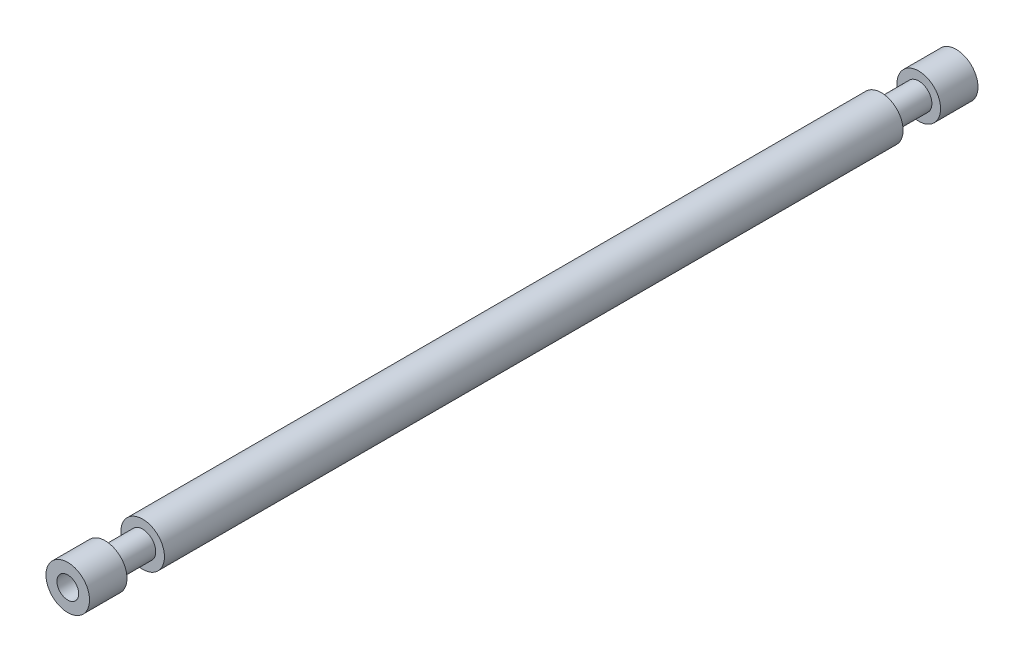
ISO-10303-21;
HEADER;
FILE_DESCRIPTION(('STEP AP214'),'2;1');
FILE_NAME('part.step','',(''),(''),'','','');
FILE_SCHEMA(('AUTOMOTIVE_DESIGN { 1 0 10303 214 1 1 1 1 }'));
ENDSEC;
DATA;
#1=APPLICATION_CONTEXT('core data for automotive mechanical design processes');
#2=APPLICATION_PROTOCOL_DEFINITION('international standard','automotive_design',2000,#1);
#3=PRODUCT_CONTEXT('',#1,'mechanical');
#4=PRODUCT('Part','Part','',(#3));
#5=PRODUCT_RELATED_PRODUCT_CATEGORY('part','',(#4));
#6=PRODUCT_DEFINITION_FORMATION('','',#4);
#7=PRODUCT_DEFINITION_CONTEXT('part definition',#1,'design');
#8=PRODUCT_DEFINITION('design','',#6,#7);
#9=PRODUCT_DEFINITION_SHAPE('','',#8);
#10=(LENGTH_UNIT() NAMED_UNIT(*) SI_UNIT(.MILLI.,.METRE.));
#11=(NAMED_UNIT(*) PLANE_ANGLE_UNIT() SI_UNIT($,.RADIAN.));
#12=(NAMED_UNIT(*) SI_UNIT($,.STERADIAN.) SOLID_ANGLE_UNIT());
#13=UNCERTAINTY_MEASURE_WITH_UNIT(LENGTH_MEASURE(1.E-05),#10,'distance_accuracy_value','');
#14=(GEOMETRIC_REPRESENTATION_CONTEXT(3) GLOBAL_UNCERTAINTY_ASSIGNED_CONTEXT((#13)) GLOBAL_UNIT_ASSIGNED_CONTEXT((#10,
#11,#12)) REPRESENTATION_CONTEXT('',''));
#15=CARTESIAN_POINT('',(0.,0.,0.));
#16=DIRECTION('',(0.,0.,1.));
#17=DIRECTION('',(1.,0.,0.));
#18=AXIS2_PLACEMENT_3D('',#15,#16,#17);
#19=CARTESIAN_POINT('',(0.,0.,259.08));
#20=DIRECTION('',(0.,0.,1.));
#21=DIRECTION('',(1.,0.,0.));
#22=AXIS2_PLACEMENT_3D('',#19,#20,#21);
#23=PLANE('',#22);
#24=CARTESIAN_POINT('',(0.,0.,259.08));
#25=DIRECTION('',(0.,0.,1.));
#26=DIRECTION('',(1.,0.,0.));
#27=AXIS2_PLACEMENT_3D('',#24,#25,#26);
#28=CIRCLE('',#27,6.35);
#29=CARTESIAN_POINT('',(6.35,0.,259.08));
#30=VERTEX_POINT('',#29);
#31=EDGE_CURVE('E11',#30,#30,#28,.T.);
#32=ORIENTED_EDGE('',*,*,#31,.T.);
#33=EDGE_LOOP('',(#32));
#34=FACE_BOUND('',#33,.T.);
#35=CARTESIAN_POINT('',(0.0144943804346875,0.00457175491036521,259.079999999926));
#36=DIRECTION('',(0.,0.,1.));
#37=DIRECTION('',(1.,0.,0.));
#38=AXIS2_PLACEMENT_3D('',#35,#36,#37);
#39=CIRCLE('',#38,3.17499725);
#40=CARTESIAN_POINT('',(3.18949163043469,0.00457175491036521,259.079999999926));
#41=VERTEX_POINT('',#40);
#42=EDGE_CURVE('E224',#41,#41,#39,.T.);
#43=ORIENTED_EDGE('',*,*,#42,.F.);
#44=EDGE_LOOP('',(#43));
#45=FACE_BOUND('',#44,.T.);
#46=ADVANCED_FACE('F28',(#34,#45),#23,.T.);
#47=CARTESIAN_POINT('',(0.,0.,0.));
#48=DIRECTION('',(0.,0.,1.));
#49=DIRECTION('',(1.,0.,0.));
#50=AXIS2_PLACEMENT_3D('',#47,#48,#49);
#51=PLANE('',#50);
#52=CARTESIAN_POINT('',(0.,0.,0.));
#53=DIRECTION('',(0.,0.,1.));
#54=DIRECTION('',(1.,0.,0.));
#55=AXIS2_PLACEMENT_3D('',#52,#53,#54);
#56=CIRCLE('',#55,6.35);
#57=CARTESIAN_POINT('',(6.35,0.,0.));
#58=VERTEX_POINT('',#57);
#59=EDGE_CURVE('E37',#58,#58,#56,.T.);
#60=ORIENTED_EDGE('',*,*,#59,.F.);
#61=EDGE_LOOP('',(#60));
#62=FACE_BOUND('',#61,.T.);
#63=CARTESIAN_POINT('',(0.00308593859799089,-0.0113117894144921,-5.6841865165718E-11));
#64=DIRECTION('',(0.,0.,-1.));
#65=DIRECTION('',(-1.,0.,0.));
#66=AXIS2_PLACEMENT_3D('',#63,#64,#65);
#67=CIRCLE('',#66,2.552697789);
#68=CARTESIAN_POINT('',(-2.54961185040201,-0.0113117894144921,-5.6841865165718E-11));
#69=VERTEX_POINT('',#68);
#70=EDGE_CURVE('E108',#69,#69,#67,.T.);
#71=ORIENTED_EDGE('',*,*,#70,.F.);
#72=EDGE_LOOP('',(#71));
#73=FACE_BOUND('',#72,.T.);
#74=ADVANCED_FACE('F62',(#62,#73),#51,.F.);
#75=CARTESIAN_POINT('',(0.,0.,259.08));
#76=DIRECTION('',(0.,0.,-1.));
#77=DIRECTION('',(-1.,0.,0.));
#78=AXIS2_PLACEMENT_3D('',#75,#76,#77);
#79=CYLINDRICAL_SURFACE('',#78,6.35);
#80=CARTESIAN_POINT('',(0.,0.,237.236));
#81=DIRECTION('',(0.,0.,1.));
#82=DIRECTION('',(1.,0.,0.));
#83=AXIS2_PLACEMENT_3D('',#80,#81,#82);
#84=CIRCLE('',#83,6.35);
#85=CARTESIAN_POINT('',(6.35,0.,237.236));
#86=VERTEX_POINT('',#85);
#87=EDGE_CURVE('E129',#86,#86,#84,.T.);
#88=ORIENTED_EDGE('',*,*,#87,.F.);
#89=EDGE_LOOP('',(#88));
#90=FACE_BOUND('',#89,.T.);
#91=CARTESIAN_POINT('',(0.,0.,21.844));
#92=DIRECTION('',(0.,0.,-1.));
#93=DIRECTION('',(-1.,0.,0.));
#94=AXIS2_PLACEMENT_3D('',#91,#92,#93);
#95=CIRCLE('',#94,6.35);
#96=CARTESIAN_POINT('',(-6.35,0.,21.844));
#97=VERTEX_POINT('',#96);
#98=EDGE_CURVE('E32',#97,#97,#95,.T.);
#99=ORIENTED_EDGE('',*,*,#98,.F.);
#100=EDGE_LOOP('',(#99));
#101=FACE_BOUND('',#100,.T.);
#102=ADVANCED_FACE('F67',(#90,#101),#79,.T.);
#103=CARTESIAN_POINT('',(0.,0.,237.236));
#104=DIRECTION('',(0.,0.,1.));
#105=DIRECTION('',(1.,0.,0.));
#106=AXIS2_PLACEMENT_3D('',#103,#104,#105);
#107=PLANE('',#106);
#108=CARTESIAN_POINT('',(0.,0.,237.236));
#109=DIRECTION('',(0.,0.,1.));
#110=DIRECTION('',(1.,0.,0.));
#111=AXIS2_PLACEMENT_3D('',#108,#109,#110);
#112=CIRCLE('',#111,3.81);
#113=CARTESIAN_POINT('',(3.81,0.,237.236));
#114=VERTEX_POINT('',#113);
#115=EDGE_CURVE('E124',#114,#114,#112,.T.);
#116=ORIENTED_EDGE('',*,*,#115,.F.);
#117=EDGE_LOOP('',(#116));
#118=FACE_BOUND('',#117,.T.);
#119=ORIENTED_EDGE('',*,*,#87,.T.);
#120=EDGE_LOOP('',(#119));
#121=FACE_BOUND('',#120,.T.);
#122=ADVANCED_FACE('F72',(#118,#121),#107,.T.);
#123=CARTESIAN_POINT('',(0.,0.,248.158));
#124=DIRECTION('',(0.,0.,1.));
#125=DIRECTION('',(1.,0.,0.));
#126=AXIS2_PLACEMENT_3D('',#123,#124,#125);
#127=PLANE('',#126);
#128=CARTESIAN_POINT('',(0.,0.,248.158));
#129=DIRECTION('',(0.,0.,1.));
#130=DIRECTION('',(1.,0.,0.));
#131=AXIS2_PLACEMENT_3D('',#128,#129,#130);
#132=CIRCLE('',#131,3.81);
#133=CARTESIAN_POINT('',(3.81,0.,248.158));
#134=VERTEX_POINT('',#133);
#135=EDGE_CURVE('E121',#134,#134,#132,.T.);
#136=ORIENTED_EDGE('',*,*,#135,.T.);
#137=EDGE_LOOP('',(#136));
#138=FACE_BOUND('',#137,.T.);
#139=CARTESIAN_POINT('',(0.,0.,248.158));
#140=DIRECTION('',(0.,0.,1.));
#141=DIRECTION('',(1.,0.,0.));
#142=AXIS2_PLACEMENT_3D('',#139,#140,#141);
#143=CIRCLE('',#142,6.35);
#144=CARTESIAN_POINT('',(6.35,0.,248.158));
#145=VERTEX_POINT('',#144);
#146=EDGE_CURVE('E127',#145,#145,#143,.T.);
#147=ORIENTED_EDGE('',*,*,#146,.F.);
#148=EDGE_LOOP('',(#147));
#149=FACE_BOUND('',#148,.T.);
#150=ADVANCED_FACE('F75',(#138,#149),#127,.F.);
#151=CARTESIAN_POINT('',(0.,0.,237.236));
#152=DIRECTION('',(0.,0.,1.));
#153=DIRECTION('',(1.,0.,0.));
#154=AXIS2_PLACEMENT_3D('',#151,#152,#153);
#155=CYLINDRICAL_SURFACE('',#154,3.81);
#156=ORIENTED_EDGE('',*,*,#115,.T.);
#157=EDGE_LOOP('',(#156));
#158=FACE_BOUND('',#157,.T.);
#159=ORIENTED_EDGE('',*,*,#135,.F.);
#160=EDGE_LOOP('',(#159));
#161=FACE_BOUND('',#160,.T.);
#162=ADVANCED_FACE('F79',(#158,#161),#155,.T.);
#163=ORIENTED_EDGE('',*,*,#146,.T.);
#164=EDGE_LOOP('',(#163));
#165=FACE_BOUND('',#164,.T.);
#166=ORIENTED_EDGE('',*,*,#31,.F.);
#167=EDGE_LOOP('',(#166));
#168=FACE_BOUND('',#167,.T.);
#169=ADVANCED_FACE('F30',(#165,#168),#79,.T.);
#170=CARTESIAN_POINT('',(0.,0.,21.844));
#171=DIRECTION('',(0.,0.,-1.));
#172=DIRECTION('',(-1.,0.,0.));
#173=AXIS2_PLACEMENT_3D('',#170,#171,#172);
#174=PLANE('',#173);
#175=CARTESIAN_POINT('',(0.,0.,21.844));
#176=DIRECTION('',(0.,0.,-1.));
#177=DIRECTION('',(-1.,0.,0.));
#178=AXIS2_PLACEMENT_3D('',#175,#176,#177);
#179=CIRCLE('',#178,3.82990044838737);
#180=CARTESIAN_POINT('',(-3.82990044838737,0.,21.844));
#181=VERTEX_POINT('',#180);
#182=EDGE_CURVE('E111',#181,#181,#179,.T.);
#183=ORIENTED_EDGE('',*,*,#182,.F.);
#184=EDGE_LOOP('',(#183));
#185=FACE_BOUND('',#184,.T.);
#186=ORIENTED_EDGE('',*,*,#98,.T.);
#187=EDGE_LOOP('',(#186));
#188=FACE_BOUND('',#187,.T.);
#189=ADVANCED_FACE('F84',(#185,#188),#174,.T.);
#190=CARTESIAN_POINT('',(0.,0.,10.922));
#191=DIRECTION('',(0.,0.,-1.));
#192=DIRECTION('',(-1.,0.,0.));
#193=AXIS2_PLACEMENT_3D('',#190,#191,#192);
#194=PLANE('',#193);
#195=CARTESIAN_POINT('',(0.,0.,10.922));
#196=DIRECTION('',(0.,0.,-1.));
#197=DIRECTION('',(-1.,0.,0.));
#198=AXIS2_PLACEMENT_3D('',#195,#196,#197);
#199=CIRCLE('',#198,3.82990044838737);
#200=CARTESIAN_POINT('',(-3.82990044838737,0.,10.922));
#201=VERTEX_POINT('',#200);
#202=EDGE_CURVE('E107',#201,#201,#199,.T.);
#203=ORIENTED_EDGE('',*,*,#202,.T.);
#204=EDGE_LOOP('',(#203));
#205=FACE_BOUND('',#204,.T.);
#206=CARTESIAN_POINT('',(0.,0.,10.922));
#207=DIRECTION('',(0.,0.,-1.));
#208=DIRECTION('',(-1.,0.,0.));
#209=AXIS2_PLACEMENT_3D('',#206,#207,#208);
#210=CIRCLE('',#209,6.35);
#211=CARTESIAN_POINT('',(-6.35,0.,10.922));
#212=VERTEX_POINT('',#211);
#213=EDGE_CURVE('E120',#212,#212,#210,.T.);
#214=ORIENTED_EDGE('',*,*,#213,.F.);
#215=EDGE_LOOP('',(#214));
#216=FACE_BOUND('',#215,.T.);
#217=ADVANCED_FACE('F87',(#205,#216),#194,.F.);
#218=CARTESIAN_POINT('',(0.,0.,21.844));
#219=DIRECTION('',(0.,0.,-1.));
#220=DIRECTION('',(-1.,0.,0.));
#221=AXIS2_PLACEMENT_3D('',#218,#219,#220);
#222=CYLINDRICAL_SURFACE('',#221,3.82990044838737);
#223=ORIENTED_EDGE('',*,*,#182,.T.);
#224=EDGE_LOOP('',(#223));
#225=FACE_BOUND('',#224,.T.);
#226=ORIENTED_EDGE('',*,*,#202,.F.);
#227=EDGE_LOOP('',(#226));
#228=FACE_BOUND('',#227,.T.);
#229=ADVANCED_FACE('F91',(#225,#228),#222,.T.);
#230=ORIENTED_EDGE('',*,*,#213,.T.);
#231=EDGE_LOOP('',(#230));
#232=FACE_BOUND('',#231,.T.);
#233=ORIENTED_EDGE('',*,*,#59,.T.);
#234=EDGE_LOOP('',(#233));
#235=FACE_BOUND('',#234,.T.);
#236=ADVANCED_FACE('F95',(#232,#235),#79,.T.);
#237=CARTESIAN_POINT('',(0.00308593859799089,-0.0113117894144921,25.3999779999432));
#238=DIRECTION('',(0.,0.,-1.));
#239=DIRECTION('',(-1.,0.,0.));
#240=AXIS2_PLACEMENT_3D('',#237,#238,#239);
#241=CONICAL_SURFACE('',#240,0.,1.0297443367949);
#242=CARTESIAN_POINT('',(0.00308593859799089,-0.0113117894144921,23.8661626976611));
#243=DIRECTION('',(0.,0.,-1.));
#244=DIRECTION('',(-1.,0.,0.));
#245=AXIS2_PLACEMENT_3D('',#242,#243,#244);
#246=CIRCLE('',#245,2.552697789);
#247=CARTESIAN_POINT('',(-2.54961185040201,-0.0113117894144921,23.8661626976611));
#248=VERTEX_POINT('',#247);
#249=EDGE_CURVE('E105',#248,#248,#246,.T.);
#250=ORIENTED_EDGE('',*,*,#249,.T.);
#251=EDGE_LOOP('',(#250));
#252=FACE_BOUND('',#251,.T.);
#253=CARTESIAN_POINT('',(0.00308593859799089,-0.0113117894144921,25.3999779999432));
#254=VERTEX_POINT('',#253);
#255=VERTEX_LOOP('',#254);
#256=FACE_BOUND('',#255,.T.);
#257=ADVANCED_FACE('F57',(#252,#256),#241,.F.);
#258=CARTESIAN_POINT('',(0.00308593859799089,-0.0113117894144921,-5.6843418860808E-11));
#259=DIRECTION('',(0.,0.,-1.));
#260=DIRECTION('',(-1.,0.,0.));
#261=AXIS2_PLACEMENT_3D('',#258,#259,#260);
#262=CYLINDRICAL_SURFACE('',#261,2.552697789);
#263=ORIENTED_EDGE('',*,*,#70,.T.);
#264=EDGE_LOOP('',(#263));
#265=FACE_BOUND('',#264,.T.);
#266=ORIENTED_EDGE('',*,*,#249,.F.);
#267=EDGE_LOOP('',(#266));
#268=FACE_BOUND('',#267,.T.);
#269=ADVANCED_FACE('F47',(#265,#268),#262,.F.);
#270=CARTESIAN_POINT('',(0.0144943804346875,0.00457175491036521,246.380010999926));
#271=DIRECTION('',(0.,0.,1.));
#272=DIRECTION('',(1.,0.,0.));
#273=AXIS2_PLACEMENT_3D('',#270,#271,#272);
#274=CONICAL_SURFACE('',#273,0.,1.0297443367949);
#275=CARTESIAN_POINT('',(0.0144943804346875,0.00457175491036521,247.913826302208));
#276=DIRECTION('',(0.,0.,1.));
#277=DIRECTION('',(1.,0.,0.));
#278=AXIS2_PLACEMENT_3D('',#275,#276,#277);
#279=CIRCLE('',#278,2.552697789);
#280=CARTESIAN_POINT('',(2.56719216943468,0.00457175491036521,247.913826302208));
#281=VERTEX_POINT('',#280);
#282=EDGE_CURVE('E114',#281,#281,#279,.T.);
#283=ORIENTED_EDGE('',*,*,#282,.T.);
#284=EDGE_LOOP('',(#283));
#285=FACE_BOUND('',#284,.T.);
#286=CARTESIAN_POINT('',(0.0144943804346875,0.00457175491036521,246.380010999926));
#287=VERTEX_POINT('',#286);
#288=VERTEX_LOOP('',#287);
#289=FACE_BOUND('',#288,.T.);
#290=ADVANCED_FACE('F44',(#285,#289),#274,.F.);
#291=CARTESIAN_POINT('',(0.0144943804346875,0.00457175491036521,259.079999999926));
#292=DIRECTION('',(0.,0.,1.));
#293=DIRECTION('',(1.,0.,0.));
#294=AXIS2_PLACEMENT_3D('',#291,#292,#293);
#295=CYLINDRICAL_SURFACE('',#294,2.552697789);
#296=CARTESIAN_POINT('',(0.0144943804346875,0.00457175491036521,247.650009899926));
#297=DIRECTION('',(0.,0.,1.));
#298=DIRECTION('',(1.,0.,0.));
#299=AXIS2_PLACEMENT_3D('',#296,#297,#298);
#300=CIRCLE('',#299,2.552697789);
#301=CARTESIAN_POINT('',(2.56719216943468,0.00457175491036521,247.650009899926));
#302=VERTEX_POINT('',#301);
#303=EDGE_CURVE('E228',#302,#302,#300,.T.);
#304=ORIENTED_EDGE('',*,*,#303,.T.);
#305=EDGE_LOOP('',(#304));
#306=FACE_BOUND('',#305,.T.);
#307=ORIENTED_EDGE('',*,*,#282,.F.);
#308=EDGE_LOOP('',(#307));
#309=FACE_BOUND('',#308,.T.);
#310=ADVANCED_FACE('F46',(#306,#309),#295,.T.);
#311=CARTESIAN_POINT('',(2.56719216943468,0.00457175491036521,247.650009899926));
#312=DIRECTION('',(0.,0.,1.));
#313=DIRECTION('',(1.,0.,0.));
#314=AXIS2_PLACEMENT_3D('',#311,#312,#313);
#315=PLANE('',#314);
#316=CARTESIAN_POINT('',(0.0144943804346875,0.00457175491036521,247.650009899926));
#317=DIRECTION('',(0.,0.,1.));
#318=DIRECTION('',(1.,0.,0.));
#319=AXIS2_PLACEMENT_3D('',#316,#317,#318);
#320=CIRCLE('',#319,3.17499725);
#321=CARTESIAN_POINT('',(3.18949163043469,0.00457175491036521,247.650009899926));
#322=VERTEX_POINT('',#321);
#323=EDGE_CURVE('E227',#322,#322,#320,.T.);
#324=ORIENTED_EDGE('',*,*,#323,.T.);
#325=EDGE_LOOP('',(#324));
#326=FACE_BOUND('',#325,.T.);
#327=ORIENTED_EDGE('',*,*,#303,.F.);
#328=EDGE_LOOP('',(#327));
#329=FACE_BOUND('',#328,.T.);
#330=ADVANCED_FACE('F54',(#326,#329),#315,.T.);
#331=CARTESIAN_POINT('',(0.0144943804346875,0.00457175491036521,259.079999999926));
#332=DIRECTION('',(0.,0.,1.));
#333=DIRECTION('',(1.,0.,0.));
#334=AXIS2_PLACEMENT_3D('',#331,#332,#333);
#335=CYLINDRICAL_SURFACE('',#334,3.17499725);
#336=ORIENTED_EDGE('',*,*,#42,.T.);
#337=EDGE_LOOP('',(#336));
#338=FACE_BOUND('',#337,.T.);
#339=ORIENTED_EDGE('',*,*,#323,.F.);
#340=EDGE_LOOP('',(#339));
#341=FACE_BOUND('',#340,.T.);
#342=ADVANCED_FACE('F204',(#338,#341),#335,.F.);
#343=CLOSED_SHELL('',(#46,#74,#102,#122,#150,#162,#169,#189,#217,#229,#236,#257,#269,#290,#310,
#330,#342));
#344=MANIFOLD_SOLID_BREP('B2',#343);
#345=ADVANCED_BREP_SHAPE_REPRESENTATION('',(#18,#344),#14);
#346=SHAPE_DEFINITION_REPRESENTATION(#9,#345);
ENDSEC;
END-ISO-10303-21;
